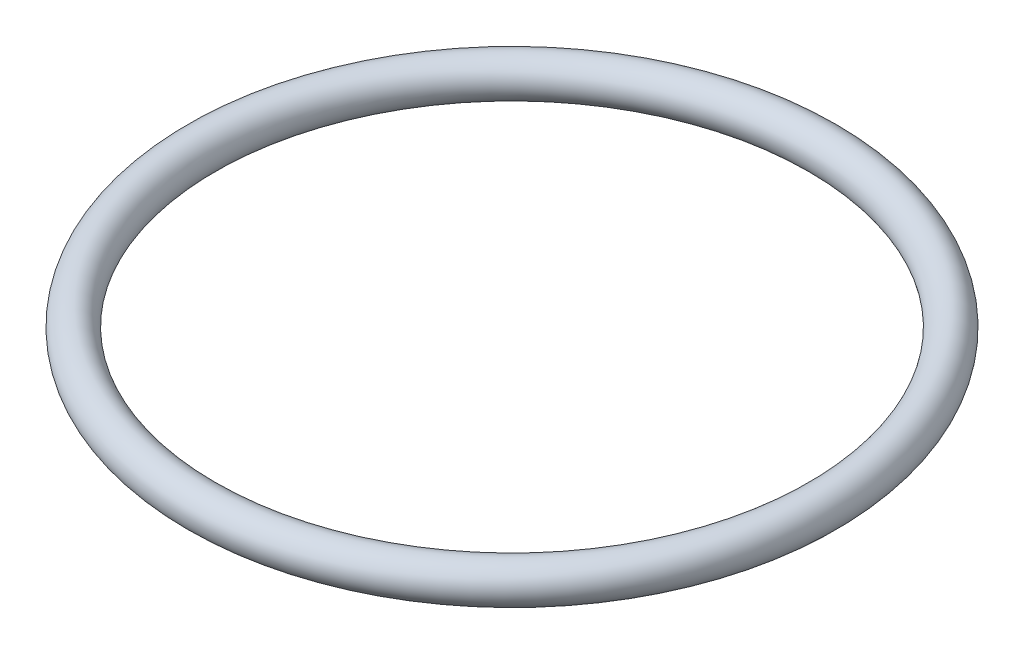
from build123d import *

# Parameters (mm, degrees)
SKETCH2_R = 0.889


with BuildPart() as part:
    # Sweep1: sweep along a path in Sketch1
    with BuildLine(Plane(origin=(0, 0, 0), x_dir=(1, 0, 0), z_dir=(0, 1, 0))) as sweep1_path:
        CenterArc((0, 0), 13.3985, 0, 360)
    # Sketch2 → Sweep1 (sweep)
    with BuildSketch(Plane.XY):
        with Locations((-14.2875, 0)):
            Circle(SKETCH2_R)
    sweep(path=sweep1_path.line)


solid = part.part
